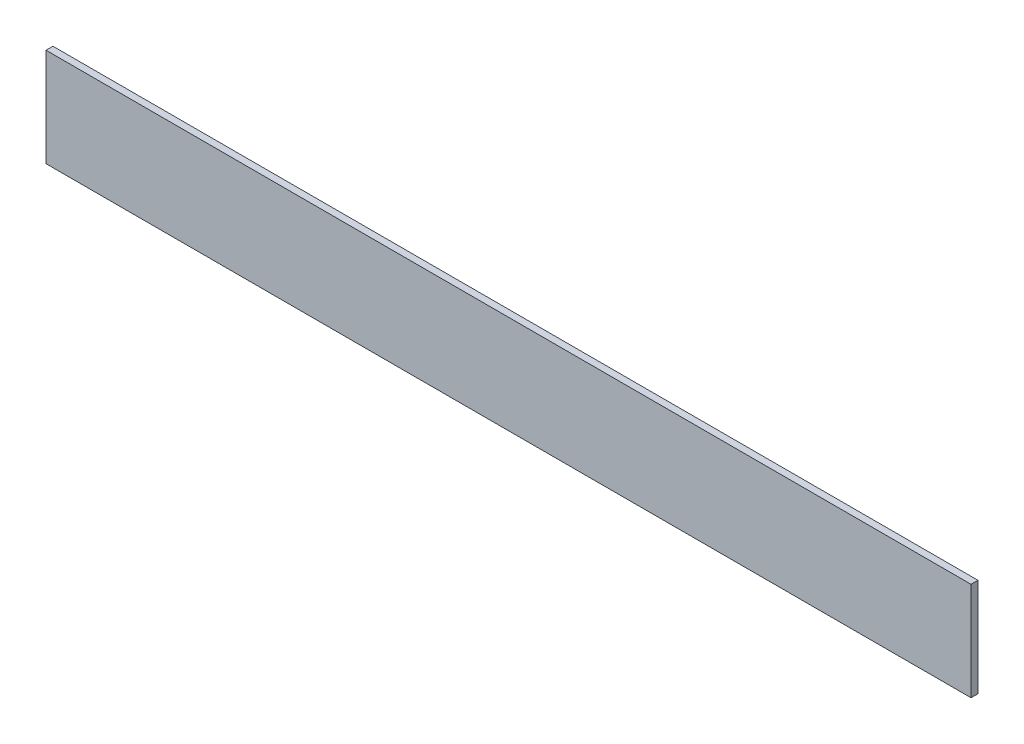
ISO-10303-21;
HEADER;
FILE_DESCRIPTION(('STEP AP214'),'2;1');
FILE_NAME('part.step','',(''),(''),'','','');
FILE_SCHEMA(('AUTOMOTIVE_DESIGN { 1 0 10303 214 1 1 1 1 }'));
ENDSEC;
DATA;
#1=APPLICATION_CONTEXT('core data for automotive mechanical design processes');
#2=APPLICATION_PROTOCOL_DEFINITION('international standard','automotive_design',2000,#1);
#3=PRODUCT_CONTEXT('',#1,'mechanical');
#4=PRODUCT('Part','Part','',(#3));
#5=PRODUCT_RELATED_PRODUCT_CATEGORY('part','',(#4));
#6=PRODUCT_DEFINITION_FORMATION('','',#4);
#7=PRODUCT_DEFINITION_CONTEXT('part definition',#1,'design');
#8=PRODUCT_DEFINITION('design','',#6,#7);
#9=PRODUCT_DEFINITION_SHAPE('','',#8);
#10=(LENGTH_UNIT() NAMED_UNIT(*) SI_UNIT(.MILLI.,.METRE.));
#11=(NAMED_UNIT(*) PLANE_ANGLE_UNIT() SI_UNIT($,.RADIAN.));
#12=(NAMED_UNIT(*) SI_UNIT($,.STERADIAN.) SOLID_ANGLE_UNIT());
#13=UNCERTAINTY_MEASURE_WITH_UNIT(LENGTH_MEASURE(1.E-05),#10,'distance_accuracy_value','');
#14=(GEOMETRIC_REPRESENTATION_CONTEXT(3) GLOBAL_UNCERTAINTY_ASSIGNED_CONTEXT((#13)) GLOBAL_UNIT_ASSIGNED_CONTEXT((#10,
#11,#12)) REPRESENTATION_CONTEXT('',''));
#15=CARTESIAN_POINT('',(0.,0.,0.));
#16=DIRECTION('',(0.,0.,1.));
#17=DIRECTION('',(1.,0.,0.));
#18=AXIS2_PLACEMENT_3D('',#15,#16,#17);
#19=CARTESIAN_POINT('',(-400.,34.7495108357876,6.));
#20=DIRECTION('',(1.,0.,0.));
#21=DIRECTION('',(0.,0.,-1.));
#22=AXIS2_PLACEMENT_3D('',#19,#20,#21);
#23=PLANE('',#22);
#24=DIRECTION('',(0.,-1.,0.));
#25=VECTOR('',#24,1.);
#26=CARTESIAN_POINT('',(-400.,34.7495108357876,0.));
#27=LINE('',#26,#25);
#28=CARTESIAN_POINT('',(-400.,34.7495108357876,0.));
#29=VERTEX_POINT('',#28);
#30=CARTESIAN_POINT('',(-400.,-50.2504891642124,0.));
#31=VERTEX_POINT('',#30);
#32=EDGE_CURVE('E76',#29,#31,#27,.T.);
#33=ORIENTED_EDGE('',*,*,#32,.T.);
#34=DIRECTION('',(0.,0.,-1.));
#35=VECTOR('',#34,1.);
#36=CARTESIAN_POINT('',(-400.,-50.2504891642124,6.));
#37=LINE('',#36,#35);
#38=CARTESIAN_POINT('',(-400.,-50.2504891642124,6.));
#39=VERTEX_POINT('',#38);
#40=EDGE_CURVE('E11',#39,#31,#37,.T.);
#41=ORIENTED_EDGE('',*,*,#40,.F.);
#42=DIRECTION('',(0.,-1.,0.));
#43=VECTOR('',#42,1.);
#44=CARTESIAN_POINT('',(-400.,34.7495108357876,6.));
#45=LINE('',#44,#43);
#46=CARTESIAN_POINT('',(-400.,34.7495108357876,6.));
#47=VERTEX_POINT('',#46);
#48=EDGE_CURVE('E94',#47,#39,#45,.T.);
#49=ORIENTED_EDGE('',*,*,#48,.F.);
#50=DIRECTION('',(0.,0.,-1.));
#51=VECTOR('',#50,1.);
#52=CARTESIAN_POINT('',(-400.,34.7495108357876,6.));
#53=LINE('',#52,#51);
#54=EDGE_CURVE('E88',#47,#29,#53,.T.);
#55=ORIENTED_EDGE('',*,*,#54,.T.);
#56=EDGE_LOOP('',(#33,#41,#49,#55));
#57=FACE_BOUND('',#56,.T.);
#58=ADVANCED_FACE('F32',(#57),#23,.F.);
#59=CARTESIAN_POINT('',(-400.,-50.2504891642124,6.));
#60=DIRECTION('',(0.,1.,0.));
#61=DIRECTION('',(0.,0.,1.));
#62=AXIS2_PLACEMENT_3D('',#59,#60,#61);
#63=PLANE('',#62);
#64=DIRECTION('',(1.,0.,0.));
#65=VECTOR('',#64,1.);
#66=CARTESIAN_POINT('',(-400.,-50.2504891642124,0.));
#67=LINE('',#66,#65);
#68=CARTESIAN_POINT('',(400.,-50.2504891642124,0.));
#69=VERTEX_POINT('',#68);
#70=EDGE_CURVE('E72',#31,#69,#67,.T.);
#71=ORIENTED_EDGE('',*,*,#70,.T.);
#72=DIRECTION('',(0.,0.,-1.));
#73=VECTOR('',#72,1.);
#74=CARTESIAN_POINT('',(400.,-50.2504891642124,6.));
#75=LINE('',#74,#73);
#76=CARTESIAN_POINT('',(400.,-50.2504891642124,6.));
#77=VERTEX_POINT('',#76);
#78=EDGE_CURVE('E39',#77,#69,#75,.T.);
#79=ORIENTED_EDGE('',*,*,#78,.F.);
#80=DIRECTION('',(1.,0.,0.));
#81=VECTOR('',#80,1.);
#82=CARTESIAN_POINT('',(-400.,-50.2504891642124,6.));
#83=LINE('',#82,#81);
#84=EDGE_CURVE('E84',#39,#77,#83,.T.);
#85=ORIENTED_EDGE('',*,*,#84,.F.);
#86=ORIENTED_EDGE('',*,*,#40,.T.);
#87=EDGE_LOOP('',(#71,#79,#85,#86));
#88=FACE_BOUND('',#87,.T.);
#89=ADVANCED_FACE('F83',(#88),#63,.F.);
#90=CARTESIAN_POINT('',(400.,34.7495108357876,6.));
#91=DIRECTION('',(-1.,0.,0.));
#92=DIRECTION('',(0.,0.,1.));
#93=AXIS2_PLACEMENT_3D('',#90,#91,#92);
#94=PLANE('',#93);
#95=DIRECTION('',(0.,1.,0.));
#96=VECTOR('',#95,1.);
#97=CARTESIAN_POINT('',(400.,34.7495108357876,0.));
#98=LINE('',#97,#96);
#99=CARTESIAN_POINT('',(400.,34.7495108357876,0.));
#100=VERTEX_POINT('',#99);
#101=EDGE_CURVE('E77',#69,#100,#98,.T.);
#102=ORIENTED_EDGE('',*,*,#101,.T.);
#103=DIRECTION('',(0.,0.,-1.));
#104=VECTOR('',#103,1.);
#105=CARTESIAN_POINT('',(400.,34.7495108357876,6.));
#106=LINE('',#105,#104);
#107=CARTESIAN_POINT('',(400.,34.7495108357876,6.));
#108=VERTEX_POINT('',#107);
#109=EDGE_CURVE('E100',#108,#100,#106,.T.);
#110=ORIENTED_EDGE('',*,*,#109,.F.);
#111=DIRECTION('',(0.,1.,0.));
#112=VECTOR('',#111,1.);
#113=CARTESIAN_POINT('',(400.,34.7495108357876,6.));
#114=LINE('',#113,#112);
#115=EDGE_CURVE('E51',#77,#108,#114,.T.);
#116=ORIENTED_EDGE('',*,*,#115,.F.);
#117=ORIENTED_EDGE('',*,*,#78,.T.);
#118=EDGE_LOOP('',(#102,#110,#116,#117));
#119=FACE_BOUND('',#118,.T.);
#120=ADVANCED_FACE('F103',(#119),#94,.F.);
#121=CARTESIAN_POINT('',(-400.,34.7495108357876,6.));
#122=DIRECTION('',(0.,-1.,0.));
#123=DIRECTION('',(0.,0.,-1.));
#124=AXIS2_PLACEMENT_3D('',#121,#122,#123);
#125=PLANE('',#124);
#126=DIRECTION('',(-1.,0.,0.));
#127=VECTOR('',#126,1.);
#128=CARTESIAN_POINT('',(-400.,34.7495108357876,0.));
#129=LINE('',#128,#127);
#130=EDGE_CURVE('E92',#100,#29,#129,.T.);
#131=ORIENTED_EDGE('',*,*,#130,.T.);
#132=ORIENTED_EDGE('',*,*,#54,.F.);
#133=DIRECTION('',(-1.,0.,0.));
#134=VECTOR('',#133,1.);
#135=CARTESIAN_POINT('',(-400.,34.7495108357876,6.));
#136=LINE('',#135,#134);
#137=EDGE_CURVE('E46',#108,#47,#136,.T.);
#138=ORIENTED_EDGE('',*,*,#137,.F.);
#139=ORIENTED_EDGE('',*,*,#109,.T.);
#140=EDGE_LOOP('',(#131,#132,#138,#139));
#141=FACE_BOUND('',#140,.T.);
#142=ADVANCED_FACE('F105',(#141),#125,.F.);
#143=CARTESIAN_POINT('',(-400.,-50.2504891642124,6.));
#144=DIRECTION('',(0.,0.,1.));
#145=DIRECTION('',(1.,0.,0.));
#146=AXIS2_PLACEMENT_3D('',#143,#144,#145);
#147=PLANE('',#146);
#148=ORIENTED_EDGE('',*,*,#48,.T.);
#149=ORIENTED_EDGE('',*,*,#84,.T.);
#150=ORIENTED_EDGE('',*,*,#115,.T.);
#151=ORIENTED_EDGE('',*,*,#137,.T.);
#152=EDGE_LOOP('',(#148,#149,#150,#151));
#153=FACE_BOUND('',#152,.T.);
#154=ADVANCED_FACE('F106',(#153),#147,.T.);
#155=CARTESIAN_POINT('',(-400.,-50.2504891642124,0.));
#156=DIRECTION('',(0.,0.,1.));
#157=DIRECTION('',(1.,0.,0.));
#158=AXIS2_PLACEMENT_3D('',#155,#156,#157);
#159=PLANE('',#158);
#160=ORIENTED_EDGE('',*,*,#32,.F.);
#161=ORIENTED_EDGE('',*,*,#130,.F.);
#162=ORIENTED_EDGE('',*,*,#101,.F.);
#163=ORIENTED_EDGE('',*,*,#70,.F.);
#164=EDGE_LOOP('',(#160,#161,#162,#163));
#165=FACE_BOUND('',#164,.T.);
#166=ADVANCED_FACE('F73',(#165),#159,.F.);
#167=CLOSED_SHELL('',(#58,#89,#120,#142,#154,#166));
#168=MANIFOLD_SOLID_BREP('B2',#167);
#169=ADVANCED_BREP_SHAPE_REPRESENTATION('',(#18,#168),#14);
#170=SHAPE_DEFINITION_REPRESENTATION(#9,#169);
ENDSEC;
END-ISO-10303-21;
